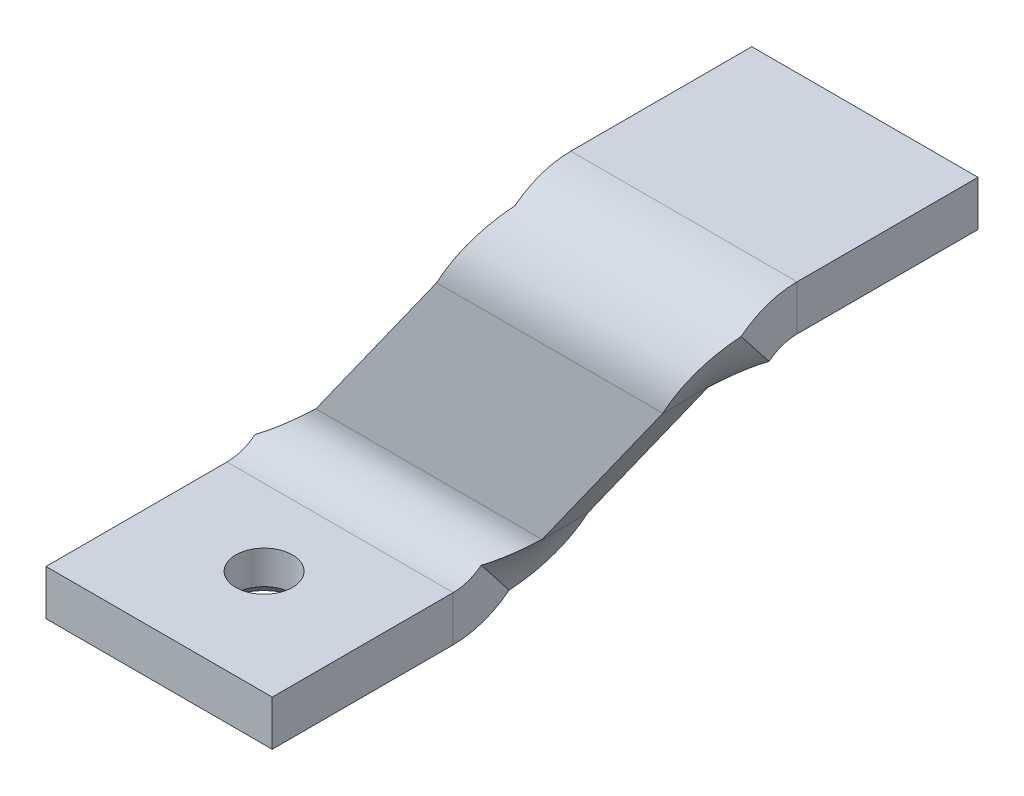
ISO-10303-21;
HEADER;
FILE_DESCRIPTION(('STEP AP214'),'2;1');
FILE_NAME('part.step','',(''),(''),'','','');
FILE_SCHEMA(('AUTOMOTIVE_DESIGN { 1 0 10303 214 1 1 1 1 }'));
ENDSEC;
DATA;
#1=APPLICATION_CONTEXT('core data for automotive mechanical design processes');
#2=APPLICATION_PROTOCOL_DEFINITION('international standard','automotive_design',2000,#1);
#3=PRODUCT_CONTEXT('',#1,'mechanical');
#4=PRODUCT('Part','Part','',(#3));
#5=PRODUCT_RELATED_PRODUCT_CATEGORY('part','',(#4));
#6=PRODUCT_DEFINITION_FORMATION('','',#4);
#7=PRODUCT_DEFINITION_CONTEXT('part definition',#1,'design');
#8=PRODUCT_DEFINITION('design','',#6,#7);
#9=PRODUCT_DEFINITION_SHAPE('','',#8);
#10=(LENGTH_UNIT() NAMED_UNIT(*) SI_UNIT(.MILLI.,.METRE.));
#11=(NAMED_UNIT(*) PLANE_ANGLE_UNIT() SI_UNIT($,.RADIAN.));
#12=(NAMED_UNIT(*) SI_UNIT($,.STERADIAN.) SOLID_ANGLE_UNIT());
#13=UNCERTAINTY_MEASURE_WITH_UNIT(LENGTH_MEASURE(1.E-05),#10,'distance_accuracy_value','');
#14=(GEOMETRIC_REPRESENTATION_CONTEXT(3) GLOBAL_UNCERTAINTY_ASSIGNED_CONTEXT((#13)) GLOBAL_UNIT_ASSIGNED_CONTEXT((#10,
#11,#12)) REPRESENTATION_CONTEXT('',''));
#15=CARTESIAN_POINT('',(0.,0.,0.));
#16=DIRECTION('',(0.,0.,1.));
#17=DIRECTION('',(1.,0.,0.));
#18=AXIS2_PLACEMENT_3D('',#15,#16,#17);
#19=CARTESIAN_POINT('',(0.,4.53818604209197,-12.2076110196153));
#20=DIRECTION('',(-0.814697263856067,0.579886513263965,0.));
#21=DIRECTION('',(0.579886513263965,0.814697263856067,0.));
#22=AXIS2_PLACEMENT_3D('',#19,#20,#21);
#23=PLANE('',#22);
#24=DIRECTION('',(0.579886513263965,0.814697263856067,0.));
#25=VECTOR('',#24,1.);
#26=CARTESIAN_POINT('',(0.,4.53818604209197,-12.2076110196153));
#27=LINE('',#26,#25);
#28=CARTESIAN_POINT('',(-7.26558959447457,-5.66942497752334,-12.2076110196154));
#29=VERTEX_POINT('',#28);
#30=CARTESIAN_POINT('',(-1.93062853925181,1.82579706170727,-12.2076110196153));
#31=VERTEX_POINT('',#30);
#32=EDGE_CURVE('E226',#29,#31,#27,.T.);
#33=ORIENTED_EDGE('',*,*,#32,.T.);
#34=CARTESIAN_POINT('',(-1.93062853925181,1.82579706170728,-14.2076110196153));
#35=CARTESIAN_POINT('',(-1.93062853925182,1.82579706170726,-12.2076110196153));
#36=B_SPLINE_CURVE_WITH_KNOTS('',1,(#34,#35),.UNSPECIFIED.,.F.,.F.,(2,2),(0.,1.),.UNSPECIFIED.);
#37=CARTESIAN_POINT('',(-1.93062853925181,1.82579706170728,-14.2076110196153));
#38=VERTEX_POINT('',#37);
#39=EDGE_CURVE('E12',#31,#38,#36,.F.);
#40=ORIENTED_EDGE('',*,*,#39,.T.);
#41=DIRECTION('',(0.579886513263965,0.814697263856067,0.));
#42=VECTOR('',#41,1.);
#43=CARTESIAN_POINT('',(0.,4.53818604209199,-14.2076110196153));
#44=LINE('',#43,#42);
#45=CARTESIAN_POINT('',(-7.26558959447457,-5.66942497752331,-14.2076110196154));
#46=VERTEX_POINT('',#45);
#47=EDGE_CURVE('E265',#46,#38,#44,.T.);
#48=ORIENTED_EDGE('',*,*,#47,.F.);
#49=CARTESIAN_POINT('',(-7.26558959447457,-5.66942497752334,-12.2076110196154));
#50=CARTESIAN_POINT('',(-7.26558959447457,-5.66942497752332,-14.2076110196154));
#51=B_SPLINE_CURVE_WITH_KNOTS('',1,(#49,#50),.UNSPECIFIED.,.F.,.F.,(2,2),(0.,1.),.UNSPECIFIED.);
#52=EDGE_CURVE('E262',#29,#46,#51,.T.);
#53=ORIENTED_EDGE('',*,*,#52,.F.);
#54=EDGE_LOOP('',(#33,#40,#48,#53));
#55=FACE_BOUND('',#54,.T.);
#56=ADVANCED_FACE('F74',(#55),#23,.T.);
#57=CARTESIAN_POINT('',(0.803781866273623,-8.38181395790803,-12.2076110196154));
#58=DIRECTION('',(0.814697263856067,-0.579886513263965,0.));
#59=DIRECTION('',(-0.579886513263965,-0.814697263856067,0.));
#60=AXIS2_PLACEMENT_3D('',#57,#58,#59);
#61=PLANE('',#60);
#62=DIRECTION('',(-0.579886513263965,-0.814697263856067,0.));
#63=VECTOR('',#62,1.);
#64=CARTESIAN_POINT('',(0.803781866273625,-8.38181395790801,-14.2076110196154));
#65=LINE('',#64,#63);
#66=CARTESIAN_POINT('',(8.06937146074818,1.82579706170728,-14.2076110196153));
#67=VERTEX_POINT('',#66);
#68=CARTESIAN_POINT('',(2.73441040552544,-5.66942497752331,-14.2076110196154));
#69=VERTEX_POINT('',#68);
#70=EDGE_CURVE('E99',#67,#69,#65,.T.);
#71=ORIENTED_EDGE('',*,*,#70,.F.);
#72=CARTESIAN_POINT('',(8.06937146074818,1.82579706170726,-12.2076110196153));
#73=CARTESIAN_POINT('',(8.06937146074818,1.82579706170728,-14.2076110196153));
#74=B_SPLINE_CURVE_WITH_KNOTS('',1,(#72,#73),.UNSPECIFIED.,.F.,.F.,(2,2),(0.,1.),.UNSPECIFIED.);
#75=CARTESIAN_POINT('',(8.06937146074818,1.82579706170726,-12.2076110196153));
#76=VERTEX_POINT('',#75);
#77=EDGE_CURVE('E202',#67,#76,#74,.F.);
#78=ORIENTED_EDGE('',*,*,#77,.T.);
#79=DIRECTION('',(-0.579886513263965,-0.814697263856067,0.));
#80=VECTOR('',#79,1.);
#81=CARTESIAN_POINT('',(0.803781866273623,-8.38181395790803,-12.2076110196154));
#82=LINE('',#81,#80);
#83=CARTESIAN_POINT('',(2.73441040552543,-5.66942497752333,-12.2076110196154));
#84=VERTEX_POINT('',#83);
#85=EDGE_CURVE('E220',#76,#84,#82,.T.);
#86=ORIENTED_EDGE('',*,*,#85,.T.);
#87=CARTESIAN_POINT('',(2.73441040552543,-5.66942497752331,-14.2076110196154));
#88=CARTESIAN_POINT('',(2.73441040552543,-5.66942497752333,-12.2076110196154));
#89=B_SPLINE_CURVE_WITH_KNOTS('',1,(#87,#88),.UNSPECIFIED.,.F.,.F.,(2,2),(0.,1.),.UNSPECIFIED.);
#90=EDGE_CURVE('E203',#69,#84,#89,.T.);
#91=ORIENTED_EDGE('',*,*,#90,.F.);
#92=EDGE_LOOP('',(#71,#78,#86,#91));
#93=FACE_BOUND('',#92,.T.);
#94=ADVANCED_FACE('F229',(#93),#61,.T.);
#95=CARTESIAN_POINT('',(0.,-2.55601689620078,-12.2076110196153));
#96=DIRECTION('',(0.,0.,1.));
#97=DIRECTION('',(-1.,0.,0.));
#98=AXIS2_PLACEMENT_3D('',#95,#96,#97);
#99=PLANE('',#98);
#100=ORIENTED_EDGE('',*,*,#85,.F.);
#101=DIRECTION('',(-1.,0.,0.));
#102=VECTOR('',#101,1.);
#103=CARTESIAN_POINT('',(0.,1.82579706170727,-12.2076110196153));
#104=LINE('',#103,#102);
#105=EDGE_CURVE('E191',#76,#31,#104,.T.);
#106=ORIENTED_EDGE('',*,*,#105,.T.);
#107=ORIENTED_EDGE('',*,*,#32,.F.);
#108=DIRECTION('',(-1.,0.,0.));
#109=VECTOR('',#108,1.);
#110=CARTESIAN_POINT('',(0.,-5.66942497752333,-12.2076110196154));
#111=LINE('',#110,#109);
#112=EDGE_CURVE('E223',#84,#29,#111,.T.);
#113=ORIENTED_EDGE('',*,*,#112,.F.);
#114=EDGE_LOOP('',(#100,#106,#107,#113));
#115=FACE_BOUND('',#114,.T.);
#116=ADVANCED_FACE('F221',(#115),#99,.T.);
#117=CARTESIAN_POINT('',(0.,-2.55601689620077,-14.2076110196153));
#118=DIRECTION('',(0.,0.,1.));
#119=DIRECTION('',(-1.,0.,0.));
#120=AXIS2_PLACEMENT_3D('',#117,#118,#119);
#121=PLANE('',#120);
#122=DIRECTION('',(-1.,0.,0.));
#123=VECTOR('',#122,1.);
#124=CARTESIAN_POINT('',(0.,1.82579706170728,-14.2076110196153));
#125=LINE('',#124,#123);
#126=EDGE_CURVE('E83',#67,#38,#125,.T.);
#127=ORIENTED_EDGE('',*,*,#126,.F.);
#128=ORIENTED_EDGE('',*,*,#70,.T.);
#129=DIRECTION('',(-1.,0.,0.));
#130=VECTOR('',#129,1.);
#131=CARTESIAN_POINT('',(0.,-5.6694249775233,-14.2076110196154));
#132=LINE('',#131,#130);
#133=EDGE_CURVE('E255',#69,#46,#132,.T.);
#134=ORIENTED_EDGE('',*,*,#133,.T.);
#135=ORIENTED_EDGE('',*,*,#47,.T.);
#136=EDGE_LOOP('',(#127,#128,#134,#135));
#137=FACE_BOUND('',#136,.T.);
#138=ADVANCED_FACE('F247',(#137),#121,.F.);
#139=CARTESIAN_POINT('',(-9.19621813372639,-7.66942497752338,-2.20761101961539));
#140=DIRECTION('',(0.,0.,1.));
#141=DIRECTION('',(0.,-1.,0.));
#142=AXIS2_PLACEMENT_3D('',#139,#140,#141);
#143=PLANE('',#142);
#144=DIRECTION('',(-1.,0.,0.));
#145=VECTOR('',#144,1.);
#146=CARTESIAN_POINT('',(-9.19621813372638,-9.66942497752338,-2.20761101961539));
#147=LINE('',#146,#145);
#148=CARTESIAN_POINT('',(0.803781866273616,-9.66942497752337,-2.20761101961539));
#149=VERTEX_POINT('',#148);
#150=CARTESIAN_POINT('',(-9.19621813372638,-9.66942497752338,-2.20761101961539));
#151=VERTEX_POINT('',#150);
#152=EDGE_CURVE('E440',#149,#151,#147,.T.);
#153=ORIENTED_EDGE('',*,*,#152,.F.);
#154=DIRECTION('',(0.,-1.,0.));
#155=VECTOR('',#154,1.);
#156=CARTESIAN_POINT('',(0.803781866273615,-7.66942497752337,-2.20761101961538));
#157=LINE('',#156,#155);
#158=CARTESIAN_POINT('',(0.803781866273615,-7.66942497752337,-2.20761101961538));
#159=VERTEX_POINT('',#158);
#160=EDGE_CURVE('E269',#159,#149,#157,.T.);
#161=ORIENTED_EDGE('',*,*,#160,.F.);
#162=DIRECTION('',(-1.,0.,0.));
#163=VECTOR('',#162,1.);
#164=CARTESIAN_POINT('',(-9.19621813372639,-7.66942497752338,-2.20761101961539));
#165=LINE('',#164,#163);
#166=CARTESIAN_POINT('',(-9.19621813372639,-7.66942497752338,-2.20761101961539));
#167=VERTEX_POINT('',#166);
#168=EDGE_CURVE('E455',#159,#167,#165,.T.);
#169=ORIENTED_EDGE('',*,*,#168,.T.);
#170=DIRECTION('',(0.,-1.,0.));
#171=VECTOR('',#170,1.);
#172=CARTESIAN_POINT('',(-9.19621813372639,-7.66942497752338,-2.20761101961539));
#173=LINE('',#172,#171);
#174=EDGE_CURVE('E454',#167,#151,#173,.T.);
#175=ORIENTED_EDGE('',*,*,#174,.T.);
#176=EDGE_LOOP('',(#153,#161,#169,#175));
#177=FACE_BOUND('',#176,.T.);
#178=ADVANCED_FACE('F513',(#177),#143,.T.);
#179=CARTESIAN_POINT('',(0.,-7.66942497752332,-18.0334080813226));
#180=DIRECTION('',(0.,1.,0.));
#181=DIRECTION('',(-1.,0.,0.));
#182=AXIS2_PLACEMENT_3D('',#179,#180,#181);
#183=PLANE('',#182);
#184=CARTESIAN_POINT('',(-4.19621813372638,-7.66942497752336,-6.84796832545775));
#185=DIRECTION('',(0.,1.,0.));
#186=DIRECTION('',(0.,0.,1.));
#187=AXIS2_PLACEMENT_3D('',#184,#185,#186);
#188=CIRCLE('',#187,1.24999999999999);
#189=CARTESIAN_POINT('',(-4.19621813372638,-7.66942497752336,-5.59796832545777));
#190=VERTEX_POINT('',#189);
#191=EDGE_CURVE('E78',#190,#190,#188,.T.);
#192=ORIENTED_EDGE('',*,*,#191,.F.);
#193=EDGE_LOOP('',(#192));
#194=FACE_BOUND('',#193,.T.);
#195=DIRECTION('',(0.,0.,1.));
#196=VECTOR('',#195,1.);
#197=CARTESIAN_POINT('',(0.803781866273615,-7.66942497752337,-2.20761101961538));
#198=LINE('',#197,#196);
#199=CARTESIAN_POINT('',(0.803781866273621,-7.66942497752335,-10.2076110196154));
#200=VERTEX_POINT('',#199);
#201=EDGE_CURVE('E432',#200,#159,#198,.T.);
#202=ORIENTED_EDGE('',*,*,#201,.F.);
#203=DIRECTION('',(-1.,0.,0.));
#204=VECTOR('',#203,1.);
#205=CARTESIAN_POINT('',(0.,-7.66942497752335,-10.2076110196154));
#206=LINE('',#205,#204);
#207=CARTESIAN_POINT('',(-9.19621813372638,-7.66942497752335,-10.2076110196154));
#208=VERTEX_POINT('',#207);
#209=EDGE_CURVE('E451',#200,#208,#206,.T.);
#210=ORIENTED_EDGE('',*,*,#209,.T.);
#211=DIRECTION('',(0.,0.,-1.));
#212=VECTOR('',#211,1.);
#213=CARTESIAN_POINT('',(-9.19621813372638,-7.66942497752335,-12.2076110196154));
#214=LINE('',#213,#212);
#215=EDGE_CURVE('E448',#167,#208,#214,.T.);
#216=ORIENTED_EDGE('',*,*,#215,.F.);
#217=ORIENTED_EDGE('',*,*,#168,.F.);
#218=EDGE_LOOP('',(#202,#210,#216,#217));
#219=FACE_BOUND('',#218,.T.);
#220=ADVANCED_FACE('F507',(#194,#219),#183,.T.);
#221=CARTESIAN_POINT('',(-9.19621813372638,-7.66942497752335,-12.2076110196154));
#222=DIRECTION('',(-1.,0.,0.));
#223=DIRECTION('',(0.,-1.,0.));
#224=AXIS2_PLACEMENT_3D('',#221,#222,#223);
#225=PLANE('',#224);
#226=ORIENTED_EDGE('',*,*,#215,.T.);
#227=DIRECTION('',(0.,-1.,0.));
#228=VECTOR('',#227,1.);
#229=CARTESIAN_POINT('',(-9.19621813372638,-7.66942497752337,-10.2076110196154));
#230=LINE('',#229,#228);
#231=CARTESIAN_POINT('',(-9.19621813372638,-9.66942497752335,-10.2076110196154));
#232=VERTEX_POINT('',#231);
#233=EDGE_CURVE('E445',#208,#232,#230,.T.);
#234=ORIENTED_EDGE('',*,*,#233,.T.);
#235=DIRECTION('',(0.,0.,-1.));
#236=VECTOR('',#235,1.);
#237=CARTESIAN_POINT('',(-9.19621813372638,-9.66942497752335,-12.2076110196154));
#238=LINE('',#237,#236);
#239=EDGE_CURVE('E437',#151,#232,#238,.T.);
#240=ORIENTED_EDGE('',*,*,#239,.F.);
#241=ORIENTED_EDGE('',*,*,#174,.F.);
#242=EDGE_LOOP('',(#226,#234,#240,#241));
#243=FACE_BOUND('',#242,.T.);
#244=ADVANCED_FACE('F503',(#243),#225,.T.);
#245=CARTESIAN_POINT('',(0.,-9.66942497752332,-18.0334080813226));
#246=DIRECTION('',(0.,1.,0.));
#247=DIRECTION('',(-1.,0.,0.));
#248=AXIS2_PLACEMENT_3D('',#245,#246,#247);
#249=PLANE('',#248);
#250=CARTESIAN_POINT('',(-4.19621813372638,-9.66942497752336,-6.84796832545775));
#251=DIRECTION('',(0.,-1.,0.));
#252=DIRECTION('',(0.,0.,-1.));
#253=AXIS2_PLACEMENT_3D('',#250,#251,#252);
#254=CIRCLE('',#253,1.775);
#255=CARTESIAN_POINT('',(-4.19621813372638,-9.66942497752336,-8.62296832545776));
#256=VERTEX_POINT('',#255);
#257=EDGE_CURVE('E905',#256,#256,#254,.T.);
#258=ORIENTED_EDGE('',*,*,#257,.F.);
#259=EDGE_LOOP('',(#258));
#260=FACE_BOUND('',#259,.T.);
#261=DIRECTION('',(-1.,0.,0.));
#262=VECTOR('',#261,1.);
#263=CARTESIAN_POINT('',(0.,-9.66942497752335,-10.2076110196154));
#264=LINE('',#263,#262);
#265=CARTESIAN_POINT('',(0.803781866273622,-9.66942497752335,-10.2076110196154));
#266=VERTEX_POINT('',#265);
#267=EDGE_CURVE('E290',#266,#232,#264,.T.);
#268=ORIENTED_EDGE('',*,*,#267,.F.);
#269=DIRECTION('',(0.,0.,1.));
#270=VECTOR('',#269,1.);
#271=CARTESIAN_POINT('',(0.803781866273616,-9.66942497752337,-2.20761101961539));
#272=LINE('',#271,#270);
#273=EDGE_CURVE('E443',#266,#149,#272,.T.);
#274=ORIENTED_EDGE('',*,*,#273,.T.);
#275=ORIENTED_EDGE('',*,*,#152,.T.);
#276=ORIENTED_EDGE('',*,*,#239,.T.);
#277=EDGE_LOOP('',(#268,#274,#275,#276));
#278=FACE_BOUND('',#277,.T.);
#279=ADVANCED_FACE('F512',(#260,#278),#249,.F.);
#280=CARTESIAN_POINT('',(0.803781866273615,-7.66942497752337,-2.20761101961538));
#281=DIRECTION('',(1.,0.,0.));
#282=DIRECTION('',(0.,0.,1.));
#283=AXIS2_PLACEMENT_3D('',#280,#281,#282);
#284=PLANE('',#283);
#285=ORIENTED_EDGE('',*,*,#273,.F.);
#286=DIRECTION('',(0.,1.,0.));
#287=VECTOR('',#286,1.);
#288=CARTESIAN_POINT('',(0.803781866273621,-7.66942497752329,-10.2076110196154));
#289=LINE('',#288,#287);
#290=EDGE_CURVE('E434',#266,#200,#289,.T.);
#291=ORIENTED_EDGE('',*,*,#290,.T.);
#292=ORIENTED_EDGE('',*,*,#201,.T.);
#293=ORIENTED_EDGE('',*,*,#160,.T.);
#294=EDGE_LOOP('',(#285,#291,#292,#293));
#295=FACE_BOUND('',#294,.T.);
#296=ADVANCED_FACE('F381',(#295),#284,.T.);
#297=CARTESIAN_POINT('',(0.803781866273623,-8.81297402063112,-12.6810902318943));
#298=CARTESIAN_POINT('',(1.12563234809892,-8.44015812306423,-13.1549026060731));
#299=CARTESIAN_POINT('',(1.44732471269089,-7.95892526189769,-13.5425022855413));
#300=CARTESIAN_POINT('',(2.09086755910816,-6.87451569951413,-14.06909618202));
#301=CARTESIAN_POINT('',(2.41255992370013,-6.27232617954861,-14.2076110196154));
#302=CARTESIAN_POINT('',(2.73441040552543,-5.66942497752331,-14.2076110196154));
#303=CARTESIAN_POINT('',(0.803781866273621,-7.24119949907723,-11.4443506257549));
#304=CARTESIAN_POINT('',(1.12560076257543,-7.05480984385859,-11.6812335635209));
#305=CARTESIAN_POINT('',(1.44732471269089,-6.81417511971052,-11.8750566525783));
#306=CARTESIAN_POINT('',(2.09086755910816,-6.27197033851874,-12.1383536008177));
#307=CARTESIAN_POINT('',(2.41259150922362,-5.97084599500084,-12.2076110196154));
#308=CARTESIAN_POINT('',(2.73441040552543,-5.66942497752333,-12.2076110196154));
#309=B_SPLINE_SURFACE_WITH_KNOTS('',1,3,((#297,#298,#299,#300,#301,#302),(#303,#304,#305,#306,
#307,#308)),.UNSPECIFIED.,.F.,.F.,.F.,(2,2),(4,2,4),(0.,1.),(0.,0.5,1.),.UNSPECIFIED.);
#310=CARTESIAN_POINT('',(0.803781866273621,-7.24119949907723,-11.4443506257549));
#311=CARTESIAN_POINT('',(0.803781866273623,-8.81297402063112,-12.6810902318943));
#312=B_SPLINE_CURVE_WITH_KNOTS('',1,(#310,#311),.UNSPECIFIED.,.F.,.F.,(2,2),(0.,1.),.UNSPECIFIED.);
#313=CARTESIAN_POINT('',(0.803781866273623,-8.81297402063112,-12.6810902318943));
#314=VERTEX_POINT('',#313);
#315=CARTESIAN_POINT('',(0.803781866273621,-7.24119949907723,-11.4443506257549));
#316=VERTEX_POINT('',#315);
#317=EDGE_CURVE('E413',#314,#316,#312,.F.);
#318=CARTESIAN_POINT('',(0.803781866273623,-8.81297402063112,-12.6810902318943));
#319=CARTESIAN_POINT('',(1.12563234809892,-8.44015812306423,-13.1549026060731));
#320=CARTESIAN_POINT('',(1.44732471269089,-7.95892526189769,-13.5425022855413));
#321=CARTESIAN_POINT('',(2.09086755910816,-6.87451569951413,-14.06909618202));
#322=CARTESIAN_POINT('',(2.41255992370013,-6.27232617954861,-14.2076110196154));
#323=CARTESIAN_POINT('',(2.73441040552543,-5.66942497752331,-14.2076110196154));
#324=B_SPLINE_CURVE_WITH_KNOTS('',3,(#318,#319,#320,#321,#322,#323),.UNSPECIFIED.,.F.,.F.,(4,2,
4),(0.,0.5,1.),.UNSPECIFIED.);
#325=EDGE_CURVE('E318',#314,#69,#324,.T.);
#326=CARTESIAN_POINT('',(2.73441040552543,-5.66942497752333,-12.2076110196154));
#327=CARTESIAN_POINT('',(2.41259150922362,-5.97084599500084,-12.2076110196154));
#328=CARTESIAN_POINT('',(2.09086755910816,-6.27197033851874,-12.1383536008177));
#329=CARTESIAN_POINT('',(1.44732471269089,-6.81417511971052,-11.8750566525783));
#330=CARTESIAN_POINT('',(1.12560076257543,-7.05480984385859,-11.6812335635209));
#331=CARTESIAN_POINT('',(0.803781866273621,-7.24119949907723,-11.4443506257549));
#332=B_SPLINE_CURVE_WITH_KNOTS('',3,(#326,#327,#328,#329,#330,#331),.UNSPECIFIED.,.F.,.F.,(4,2,
4),(0.,0.5,1.),.UNSPECIFIED.);
#333=EDGE_CURVE('E358',#316,#84,#332,.F.);
#334=ORIENTED_EDGE('',*,*,#317,.F.);
#335=ORIENTED_EDGE('',*,*,#325,.T.);
#336=ORIENTED_EDGE('',*,*,#90,.T.);
#337=ORIENTED_EDGE('',*,*,#333,.F.);
#338=EDGE_LOOP('',(#334,#335,#336,#337));
#339=FACE_BOUND('',#338,.T.);
#340=ADVANCED_FACE('F370',(#339),#309,.F.);
#341=CARTESIAN_POINT('',(-7.26558959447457,-5.66942497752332,-14.2076110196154));
#342=CARTESIAN_POINT('',(-7.58744007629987,-6.27232617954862,-14.2076110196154));
#343=CARTESIAN_POINT('',(-7.90913244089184,-6.87451569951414,-14.06909618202));
#344=CARTESIAN_POINT('',(-8.55267528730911,-7.95892526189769,-13.5425022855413));
#345=CARTESIAN_POINT('',(-8.87436765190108,-8.44015812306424,-13.1549026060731));
#346=CARTESIAN_POINT('',(-9.19621813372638,-8.81297402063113,-12.6810902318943));
#347=CARTESIAN_POINT('',(-7.26558959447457,-5.66942497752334,-12.2076110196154));
#348=CARTESIAN_POINT('',(-7.58740849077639,-5.97084599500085,-12.2076110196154));
#349=CARTESIAN_POINT('',(-7.90913244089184,-6.27197033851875,-12.1383536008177));
#350=CARTESIAN_POINT('',(-8.55267528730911,-6.81417511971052,-11.8750566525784));
#351=CARTESIAN_POINT('',(-8.87439923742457,-7.05480984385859,-11.6812335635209));
#352=CARTESIAN_POINT('',(-9.19621813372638,-7.24119949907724,-11.4443506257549));
#353=B_SPLINE_SURFACE_WITH_KNOTS('',1,3,((#341,#342,#343,#344,#345,#346),(#347,#348,#349,#350,
#351,#352)),.UNSPECIFIED.,.F.,.F.,.F.,(2,2),(4,2,4),(0.,1.),(0.,0.5,1.),.UNSPECIFIED.);
#354=CARTESIAN_POINT('',(-7.26558959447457,-5.66942497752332,-14.2076110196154));
#355=CARTESIAN_POINT('',(-7.58744007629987,-6.27232617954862,-14.2076110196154));
#356=CARTESIAN_POINT('',(-7.90913244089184,-6.87451569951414,-14.06909618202));
#357=CARTESIAN_POINT('',(-8.55267528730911,-7.95892526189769,-13.5425022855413));
#358=CARTESIAN_POINT('',(-8.87436765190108,-8.44015812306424,-13.1549026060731));
#359=CARTESIAN_POINT('',(-9.19621813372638,-8.81297402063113,-12.6810902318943));
#360=B_SPLINE_CURVE_WITH_KNOTS('',3,(#354,#355,#356,#357,#358,#359),.UNSPECIFIED.,.F.,.F.,(4,2,
4),(0.,0.5,1.),.UNSPECIFIED.);
#361=CARTESIAN_POINT('',(-9.19621813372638,-8.81297402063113,-12.6810902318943));
#362=VERTEX_POINT('',#361);
#363=EDGE_CURVE('E303',#46,#362,#360,.T.);
#364=CARTESIAN_POINT('',(-9.19621813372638,-8.81297402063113,-12.6810902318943));
#365=CARTESIAN_POINT('',(-9.19621813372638,-7.24119949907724,-11.4443506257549));
#366=B_SPLINE_CURVE_WITH_KNOTS('',1,(#364,#365),.UNSPECIFIED.,.F.,.F.,(2,2),(0.,1.),.UNSPECIFIED.);
#367=CARTESIAN_POINT('',(-9.19621813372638,-7.24119949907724,-11.4443506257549));
#368=VERTEX_POINT('',#367);
#369=EDGE_CURVE('E462',#362,#368,#366,.T.);
#370=CARTESIAN_POINT('',(-9.19621813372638,-7.24119949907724,-11.4443506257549));
#371=CARTESIAN_POINT('',(-8.87439923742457,-7.05480984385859,-11.6812335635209));
#372=CARTESIAN_POINT('',(-8.55267528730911,-6.81417511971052,-11.8750566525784));
#373=CARTESIAN_POINT('',(-7.90913244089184,-6.27197033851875,-12.1383536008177));
#374=CARTESIAN_POINT('',(-7.58740849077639,-5.97084599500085,-12.2076110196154));
#375=CARTESIAN_POINT('',(-7.26558959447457,-5.66942497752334,-12.2076110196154));
#376=B_SPLINE_CURVE_WITH_KNOTS('',3,(#370,#371,#372,#373,#374,#375),.UNSPECIFIED.,.F.,.F.,(4,2,
4),(0.,0.5,1.),.UNSPECIFIED.);
#377=EDGE_CURVE('E305',#29,#368,#376,.F.);
#378=ORIENTED_EDGE('',*,*,#52,.T.);
#379=ORIENTED_EDGE('',*,*,#363,.T.);
#380=ORIENTED_EDGE('',*,*,#369,.T.);
#381=ORIENTED_EDGE('',*,*,#377,.F.);
#382=EDGE_LOOP('',(#378,#379,#380,#381));
#383=FACE_BOUND('',#382,.T.);
#384=ADVANCED_FACE('F302',(#383),#353,.F.);
#385=CARTESIAN_POINT('',(-9.19621813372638,-5.66942497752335,-10.2076110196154));
#386=DIRECTION('',(1.,0.,0.));
#387=DIRECTION('',(0.,1.,0.));
#388=AXIS2_PLACEMENT_3D('',#385,#386,#387);
#389=PLANE('',#388);
#390=ORIENTED_EDGE('',*,*,#369,.F.);
#391=CARTESIAN_POINT('',(-9.19621813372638,-5.66942497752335,-10.2076110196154));
#392=DIRECTION('',(-1.,0.,0.));
#393=DIRECTION('',(0.,-1.,0.));
#394=AXIS2_PLACEMENT_3D('',#391,#392,#393);
#395=CIRCLE('',#394,4.);
#396=EDGE_CURVE('E317',#362,#232,#395,.T.);
#397=ORIENTED_EDGE('',*,*,#396,.T.);
#398=ORIENTED_EDGE('',*,*,#233,.F.);
#399=CARTESIAN_POINT('',(-9.19621813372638,-5.66942497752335,-10.2076110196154));
#400=DIRECTION('',(-1.,0.,0.));
#401=DIRECTION('',(0.,1.,0.));
#402=AXIS2_PLACEMENT_3D('',#399,#400,#401);
#403=CIRCLE('',#402,2.);
#404=EDGE_CURVE('E464',#368,#208,#403,.T.);
#405=ORIENTED_EDGE('',*,*,#404,.F.);
#406=EDGE_LOOP('',(#390,#397,#398,#405));
#407=FACE_BOUND('',#406,.T.);
#408=ADVANCED_FACE('F340',(#407),#389,.F.);
#409=CARTESIAN_POINT('',(0.803781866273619,-5.66942497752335,-10.2076110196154));
#410=DIRECTION('',(-1.,0.,0.));
#411=DIRECTION('',(0.,-1.,0.));
#412=AXIS2_PLACEMENT_3D('',#409,#410,#411);
#413=PLANE('',#412);
#414=CARTESIAN_POINT('',(0.803781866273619,-5.66942497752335,-10.2076110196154));
#415=DIRECTION('',(-1.,0.,0.));
#416=DIRECTION('',(0.,-1.,0.));
#417=AXIS2_PLACEMENT_3D('',#414,#415,#416);
#418=CIRCLE('',#417,4.);
#419=EDGE_CURVE('E350',#266,#314,#418,.F.);
#420=ORIENTED_EDGE('',*,*,#419,.T.);
#421=ORIENTED_EDGE('',*,*,#317,.T.);
#422=CARTESIAN_POINT('',(0.803781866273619,-5.66942497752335,-10.2076110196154));
#423=DIRECTION('',(1.,0.,0.));
#424=DIRECTION('',(0.,-1.,0.));
#425=AXIS2_PLACEMENT_3D('',#422,#423,#424);
#426=CIRCLE('',#425,2.);
#427=EDGE_CURVE('E463',#200,#316,#426,.T.);
#428=ORIENTED_EDGE('',*,*,#427,.F.);
#429=ORIENTED_EDGE('',*,*,#290,.F.);
#430=EDGE_LOOP('',(#420,#421,#428,#429));
#431=FACE_BOUND('',#430,.T.);
#432=ADVANCED_FACE('F385',(#431),#413,.F.);
#433=CARTESIAN_POINT('',(8.78632812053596,-5.66942497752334,-10.2076110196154));
#434=DIRECTION('',(-1.,0.,0.));
#435=DIRECTION('',(0.,-1.,0.));
#436=AXIS2_PLACEMENT_3D('',#433,#434,#435);
#437=CYLINDRICAL_SURFACE('',#436,2.);
#438=ORIENTED_EDGE('',*,*,#209,.F.);
#439=ORIENTED_EDGE('',*,*,#427,.T.);
#440=ORIENTED_EDGE('',*,*,#333,.T.);
#441=ORIENTED_EDGE('',*,*,#112,.T.);
#442=ORIENTED_EDGE('',*,*,#377,.T.);
#443=ORIENTED_EDGE('',*,*,#404,.T.);
#444=EDGE_LOOP('',(#438,#439,#440,#441,#442,#443));
#445=FACE_BOUND('',#444,.T.);
#446=ADVANCED_FACE('F337',(#445),#437,.F.);
#447=CARTESIAN_POINT('',(8.78632812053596,-5.66942497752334,-10.2076110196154));
#448=DIRECTION('',(-1.,0.,0.));
#449=DIRECTION('',(0.,-1.,0.));
#450=AXIS2_PLACEMENT_3D('',#447,#448,#449);
#451=CYLINDRICAL_SURFACE('',#450,4.);
#452=ORIENTED_EDGE('',*,*,#267,.T.);
#453=ORIENTED_EDGE('',*,*,#396,.F.);
#454=ORIENTED_EDGE('',*,*,#363,.F.);
#455=ORIENTED_EDGE('',*,*,#133,.F.);
#456=ORIENTED_EDGE('',*,*,#325,.F.);
#457=ORIENTED_EDGE('',*,*,#419,.F.);
#458=EDGE_LOOP('',(#452,#453,#454,#455,#456,#457));
#459=FACE_BOUND('',#458,.T.);
#460=ADVANCED_FACE('F314',(#459),#451,.T.);
#461=CARTESIAN_POINT('',(9.99999999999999,5.82579706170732,-24.2076110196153));
#462=DIRECTION('',(0.,0.,-1.));
#463=DIRECTION('',(1.,0.,0.));
#464=AXIS2_PLACEMENT_3D('',#461,#462,#463);
#465=PLANE('',#464);
#466=DIRECTION('',(1.,0.,0.));
#467=VECTOR('',#466,1.);
#468=CARTESIAN_POINT('',(9.99999999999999,3.82579706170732,-24.2076110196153));
#469=LINE('',#468,#467);
#470=CARTESIAN_POINT('',(0.,3.82579706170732,-24.2076110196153));
#471=VERTEX_POINT('',#470);
#472=CARTESIAN_POINT('',(9.99999999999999,3.82579706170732,-24.2076110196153));
#473=VERTEX_POINT('',#472);
#474=EDGE_CURVE('E916',#471,#473,#469,.T.);
#475=ORIENTED_EDGE('',*,*,#474,.F.);
#476=DIRECTION('',(0.,-1.,0.));
#477=VECTOR('',#476,1.);
#478=CARTESIAN_POINT('',(0.,5.82579706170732,-24.2076110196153));
#479=LINE('',#478,#477);
#480=CARTESIAN_POINT('',(0.,5.82579706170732,-24.2076110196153));
#481=VERTEX_POINT('',#480);
#482=EDGE_CURVE('E950',#481,#471,#479,.T.);
#483=ORIENTED_EDGE('',*,*,#482,.F.);
#484=DIRECTION('',(1.,0.,0.));
#485=VECTOR('',#484,1.);
#486=CARTESIAN_POINT('',(9.99999999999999,5.82579706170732,-24.2076110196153));
#487=LINE('',#486,#485);
#488=CARTESIAN_POINT('',(9.99999999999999,5.82579706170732,-24.2076110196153));
#489=VERTEX_POINT('',#488);
#490=EDGE_CURVE('E925',#481,#489,#487,.T.);
#491=ORIENTED_EDGE('',*,*,#490,.T.);
#492=DIRECTION('',(0.,-1.,0.));
#493=VECTOR('',#492,1.);
#494=CARTESIAN_POINT('',(9.99999999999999,5.82579706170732,-24.2076110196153));
#495=LINE('',#494,#493);
#496=EDGE_CURVE('E923',#489,#473,#495,.T.);
#497=ORIENTED_EDGE('',*,*,#496,.T.);
#498=EDGE_LOOP('',(#475,#483,#491,#497));
#499=FACE_BOUND('',#498,.T.);
#500=ADVANCED_FACE('F336',(#499),#465,.T.);
#501=CARTESIAN_POINT('',(0.,5.82579706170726,-7.11340808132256));
#502=DIRECTION('',(0.,1.,0.));
#503=DIRECTION('',(-1.,0.,0.));
#504=AXIS2_PLACEMENT_3D('',#501,#502,#503);
#505=PLANE('',#504);
#506=DIRECTION('',(-1.,0.,0.));
#507=VECTOR('',#506,1.);
#508=CARTESIAN_POINT('',(0.,5.82579706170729,-16.2076110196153));
#509=LINE('',#508,#507);
#510=CARTESIAN_POINT('',(10.,5.82579706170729,-16.2076110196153));
#511=VERTEX_POINT('',#510);
#512=CARTESIAN_POINT('',(0.,5.8257970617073,-16.2076110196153));
#513=VERTEX_POINT('',#512);
#514=EDGE_CURVE('E887',#511,#513,#509,.T.);
#515=ORIENTED_EDGE('',*,*,#514,.F.);
#516=DIRECTION('',(0.,0.,1.));
#517=VECTOR('',#516,1.);
#518=CARTESIAN_POINT('',(10.,5.82579706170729,-14.2076110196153));
#519=LINE('',#518,#517);
#520=EDGE_CURVE('E918',#489,#511,#519,.T.);
#521=ORIENTED_EDGE('',*,*,#520,.F.);
#522=ORIENTED_EDGE('',*,*,#490,.F.);
#523=DIRECTION('',(0.,0.,-1.));
#524=VECTOR('',#523,1.);
#525=CARTESIAN_POINT('',(0.,5.82579706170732,-24.2076110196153));
#526=LINE('',#525,#524);
#527=EDGE_CURVE('E948',#513,#481,#526,.T.);
#528=ORIENTED_EDGE('',*,*,#527,.F.);
#529=EDGE_LOOP('',(#515,#521,#522,#528));
#530=FACE_BOUND('',#529,.T.);
#531=ADVANCED_FACE('F619',(#530),#505,.T.);
#532=CARTESIAN_POINT('',(10.,5.82579706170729,-14.2076110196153));
#533=DIRECTION('',(1.,0.,0.));
#534=DIRECTION('',(0.,0.,1.));
#535=AXIS2_PLACEMENT_3D('',#532,#533,#534);
#536=PLANE('',#535);
#537=DIRECTION('',(0.,1.,0.));
#538=VECTOR('',#537,1.);
#539=CARTESIAN_POINT('',(10.,5.82579706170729,-16.2076110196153));
#540=LINE('',#539,#538);
#541=CARTESIAN_POINT('',(10.,3.8257970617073,-16.2076110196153));
#542=VERTEX_POINT('',#541);
#543=EDGE_CURVE('E928',#542,#511,#540,.T.);
#544=ORIENTED_EDGE('',*,*,#543,.F.);
#545=DIRECTION('',(0.,0.,1.));
#546=VECTOR('',#545,1.);
#547=CARTESIAN_POINT('',(10.,3.82579706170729,-14.2076110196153));
#548=LINE('',#547,#546);
#549=EDGE_CURVE('E914',#473,#542,#548,.T.);
#550=ORIENTED_EDGE('',*,*,#549,.F.);
#551=ORIENTED_EDGE('',*,*,#496,.F.);
#552=ORIENTED_EDGE('',*,*,#520,.T.);
#553=EDGE_LOOP('',(#544,#550,#551,#552));
#554=FACE_BOUND('',#553,.T.);
#555=ADVANCED_FACE('F631',(#554),#536,.T.);
#556=CARTESIAN_POINT('',(0.,3.82579706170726,-7.11340808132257));
#557=DIRECTION('',(0.,1.,0.));
#558=DIRECTION('',(-1.,0.,0.));
#559=AXIS2_PLACEMENT_3D('',#556,#557,#558);
#560=PLANE('',#559);
#561=ORIENTED_EDGE('',*,*,#549,.T.);
#562=DIRECTION('',(-1.,0.,0.));
#563=VECTOR('',#562,1.);
#564=CARTESIAN_POINT('',(0.,3.8257970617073,-16.2076110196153));
#565=LINE('',#564,#563);
#566=CARTESIAN_POINT('',(0.,3.8257970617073,-16.2076110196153));
#567=VERTEX_POINT('',#566);
#568=EDGE_CURVE('E892',#542,#567,#565,.T.);
#569=ORIENTED_EDGE('',*,*,#568,.T.);
#570=DIRECTION('',(0.,0.,-1.));
#571=VECTOR('',#570,1.);
#572=CARTESIAN_POINT('',(0.,3.82579706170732,-24.2076110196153));
#573=LINE('',#572,#571);
#574=EDGE_CURVE('E913',#567,#471,#573,.T.);
#575=ORIENTED_EDGE('',*,*,#574,.T.);
#576=ORIENTED_EDGE('',*,*,#474,.T.);
#577=EDGE_LOOP('',(#561,#569,#575,#576));
#578=FACE_BOUND('',#577,.T.);
#579=ADVANCED_FACE('F642',(#578),#560,.F.);
#580=CARTESIAN_POINT('',(0.,5.82579706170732,-24.2076110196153));
#581=DIRECTION('',(-1.,0.,0.));
#582=DIRECTION('',(0.,0.,-1.));
#583=AXIS2_PLACEMENT_3D('',#580,#581,#582);
#584=PLANE('',#583);
#585=DIRECTION('',(0.,-1.,0.));
#586=VECTOR('',#585,1.);
#587=CARTESIAN_POINT('',(0.,5.8257970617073,-16.2076110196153));
#588=LINE('',#587,#586);
#589=EDGE_CURVE('E930',#513,#567,#588,.T.);
#590=ORIENTED_EDGE('',*,*,#589,.F.);
#591=ORIENTED_EDGE('',*,*,#527,.T.);
#592=ORIENTED_EDGE('',*,*,#482,.T.);
#593=ORIENTED_EDGE('',*,*,#574,.F.);
#594=EDGE_LOOP('',(#590,#591,#592,#593));
#595=FACE_BOUND('',#594,.T.);
#596=ADVANCED_FACE('F654',(#595),#584,.T.);
#597=CARTESIAN_POINT('',(8.06937146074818,1.82579706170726,-12.2076110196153));
#598=CARTESIAN_POINT('',(8.39122194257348,2.42869826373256,-12.2076110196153));
#599=CARTESIAN_POINT('',(8.71291430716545,3.03088778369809,-12.3461258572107));
#600=CARTESIAN_POINT('',(9.35645715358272,4.11529734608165,-12.8727197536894));
#601=CARTESIAN_POINT('',(9.6781495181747,4.59653020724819,-13.2603194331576));
#602=CARTESIAN_POINT('',(9.99999999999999,4.96934610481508,-13.7341318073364));
#603=CARTESIAN_POINT('',(8.06937146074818,1.82579706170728,-14.2076110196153));
#604=CARTESIAN_POINT('',(8.39119035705,2.12721807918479,-14.2076110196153));
#605=CARTESIAN_POINT('',(8.71291430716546,2.42834242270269,-14.276868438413));
#606=CARTESIAN_POINT('',(9.35645715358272,2.97054720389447,-14.5401653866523));
#607=CARTESIAN_POINT('',(9.67818110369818,3.21118192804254,-14.7339884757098));
#608=CARTESIAN_POINT('',(9.99999999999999,3.39757158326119,-14.9708714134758));
#609=B_SPLINE_SURFACE_WITH_KNOTS('',1,3,((#597,#598,#599,#600,#601,#602),(#603,#604,#605,#606,
#607,#608)),.UNSPECIFIED.,.F.,.F.,.F.,(2,2),(4,2,4),(0.,1.),(0.,0.5,1.),.UNSPECIFIED.);
#610=CARTESIAN_POINT('',(8.06937146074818,1.82579706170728,-14.2076110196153));
#611=CARTESIAN_POINT('',(8.39119035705,2.12721807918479,-14.2076110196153));
#612=CARTESIAN_POINT('',(8.71291430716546,2.42834242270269,-14.276868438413));
#613=CARTESIAN_POINT('',(9.35645715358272,2.97054720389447,-14.5401653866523));
#614=CARTESIAN_POINT('',(9.67818110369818,3.21118192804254,-14.7339884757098));
#615=CARTESIAN_POINT('',(9.99999999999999,3.39757158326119,-14.9708714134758));
#616=B_SPLINE_CURVE_WITH_KNOTS('',3,(#610,#611,#612,#613,#614,#615),.UNSPECIFIED.,.F.,.F.,(4,2,
4),(0.,0.5,1.),.UNSPECIFIED.);
#617=CARTESIAN_POINT('',(9.99999999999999,3.39757158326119,-14.9708714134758));
#618=VERTEX_POINT('',#617);
#619=EDGE_CURVE('E889',#67,#618,#616,.T.);
#620=CARTESIAN_POINT('',(9.99999999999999,3.39757158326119,-14.9708714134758));
#621=CARTESIAN_POINT('',(9.99999999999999,4.96934610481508,-13.7341318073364));
#622=B_SPLINE_CURVE_WITH_KNOTS('',1,(#620,#621),.UNSPECIFIED.,.F.,.F.,(2,2),(0.,1.),.UNSPECIFIED.);
#623=CARTESIAN_POINT('',(9.99999999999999,4.96934610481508,-13.7341318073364));
#624=VERTEX_POINT('',#623);
#625=EDGE_CURVE('E212',#618,#624,#622,.T.);
#626=CARTESIAN_POINT('',(9.99999999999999,4.96934610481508,-13.7341318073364));
#627=CARTESIAN_POINT('',(9.6781495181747,4.59653020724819,-13.2603194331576));
#628=CARTESIAN_POINT('',(9.35645715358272,4.11529734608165,-12.8727197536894));
#629=CARTESIAN_POINT('',(8.71291430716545,3.03088778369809,-12.3461258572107));
#630=CARTESIAN_POINT('',(8.39122194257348,2.42869826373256,-12.2076110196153));
#631=CARTESIAN_POINT('',(8.06937146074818,1.82579706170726,-12.2076110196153));
#632=B_SPLINE_CURVE_WITH_KNOTS('',3,(#626,#627,#628,#629,#630,#631),.UNSPECIFIED.,.F.,.F.,(4,2,
4),(0.,0.5,1.),.UNSPECIFIED.);
#633=EDGE_CURVE('E195',#76,#624,#632,.F.);
#634=ORIENTED_EDGE('',*,*,#77,.F.);
#635=ORIENTED_EDGE('',*,*,#619,.T.);
#636=ORIENTED_EDGE('',*,*,#625,.T.);
#637=ORIENTED_EDGE('',*,*,#633,.F.);
#638=EDGE_LOOP('',(#634,#635,#636,#637));
#639=FACE_BOUND('',#638,.T.);
#640=ADVANCED_FACE('F207',(#639),#609,.T.);
#641=CARTESIAN_POINT('',(10.,1.8257970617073,-16.2076110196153));
#642=DIRECTION('',(1.,0.,0.));
#643=DIRECTION('',(0.,0.,-1.));
#644=AXIS2_PLACEMENT_3D('',#641,#642,#643);
#645=PLANE('',#644);
#646=ORIENTED_EDGE('',*,*,#625,.F.);
#647=CARTESIAN_POINT('',(9.99999999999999,1.8257970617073,-16.2076110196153));
#648=DIRECTION('',(1.,0.,0.));
#649=DIRECTION('',(0.,0.,-1.));
#650=AXIS2_PLACEMENT_3D('',#647,#648,#649);
#651=CIRCLE('',#650,2.);
#652=EDGE_CURVE('E806',#618,#542,#651,.F.);
#653=ORIENTED_EDGE('',*,*,#652,.T.);
#654=ORIENTED_EDGE('',*,*,#543,.T.);
#655=CARTESIAN_POINT('',(10.,1.8257970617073,-16.2076110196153));
#656=DIRECTION('',(-1.,0.,0.));
#657=DIRECTION('',(0.,0.,-1.));
#658=AXIS2_PLACEMENT_3D('',#655,#656,#657);
#659=CIRCLE('',#658,4.);
#660=EDGE_CURVE('E215',#624,#511,#659,.T.);
#661=ORIENTED_EDGE('',*,*,#660,.F.);
#662=EDGE_LOOP('',(#646,#653,#654,#661));
#663=FACE_BOUND('',#662,.T.);
#664=ADVANCED_FACE('F671',(#663),#645,.T.);
#665=CARTESIAN_POINT('',(0.,1.8257970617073,-16.2076110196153));
#666=DIRECTION('',(-1.,0.,0.));
#667=DIRECTION('',(0.,0.,1.));
#668=AXIS2_PLACEMENT_3D('',#665,#666,#667);
#669=PLANE('',#668);
#670=ORIENTED_EDGE('',*,*,#589,.T.);
#671=CARTESIAN_POINT('',(0.,1.8257970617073,-16.2076110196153));
#672=DIRECTION('',(1.,0.,0.));
#673=DIRECTION('',(0.,0.,-1.));
#674=AXIS2_PLACEMENT_3D('',#671,#672,#673);
#675=CIRCLE('',#674,2.);
#676=CARTESIAN_POINT('',(0.,3.39757158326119,-14.9708714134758));
#677=VERTEX_POINT('',#676);
#678=EDGE_CURVE('E798',#567,#677,#675,.T.);
#679=ORIENTED_EDGE('',*,*,#678,.T.);
#680=CARTESIAN_POINT('',(0.,4.96934610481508,-13.7341318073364));
#681=CARTESIAN_POINT('',(0.,3.39757158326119,-14.9708714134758));
#682=B_SPLINE_CURVE_WITH_KNOTS('',1,(#680,#681),.UNSPECIFIED.,.F.,.F.,(2,2),(0.,1.),.UNSPECIFIED.);
#683=CARTESIAN_POINT('',(0.,4.96934610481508,-13.7341318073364));
#684=VERTEX_POINT('',#683);
#685=EDGE_CURVE('E849',#677,#684,#682,.F.);
#686=ORIENTED_EDGE('',*,*,#685,.T.);
#687=CARTESIAN_POINT('',(0.,1.8257970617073,-16.2076110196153));
#688=DIRECTION('',(1.,0.,0.));
#689=DIRECTION('',(0.,0.,1.));
#690=AXIS2_PLACEMENT_3D('',#687,#688,#689);
#691=CIRCLE('',#690,4.);
#692=EDGE_CURVE('E787',#513,#684,#691,.T.);
#693=ORIENTED_EDGE('',*,*,#692,.F.);
#694=EDGE_LOOP('',(#670,#679,#686,#693));
#695=FACE_BOUND('',#694,.T.);
#696=ADVANCED_FACE('F681',(#695),#669,.T.);
#697=CARTESIAN_POINT('',(0.,4.96934610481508,-13.7341318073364));
#698=CARTESIAN_POINT('',(-0.3218504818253,4.59653020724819,-13.2603194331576));
#699=CARTESIAN_POINT('',(-0.643542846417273,4.11529734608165,-12.8727197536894));
#700=CARTESIAN_POINT('',(-1.28708569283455,3.03088778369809,-12.3461258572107));
#701=CARTESIAN_POINT('',(-1.60877805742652,2.42869826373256,-12.2076110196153));
#702=CARTESIAN_POINT('',(-1.93062853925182,1.82579706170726,-12.2076110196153));
#703=CARTESIAN_POINT('',(0.,3.39757158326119,-14.9708714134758));
#704=CARTESIAN_POINT('',(-0.321818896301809,3.21118192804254,-14.7339884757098));
#705=CARTESIAN_POINT('',(-0.643542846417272,2.97054720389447,-14.5401653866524));
#706=CARTESIAN_POINT('',(-1.28708569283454,2.42834242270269,-14.276868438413));
#707=CARTESIAN_POINT('',(-1.60880964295,2.12721807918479,-14.2076110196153));
#708=CARTESIAN_POINT('',(-1.93062853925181,1.82579706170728,-14.2076110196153));
#709=B_SPLINE_SURFACE_WITH_KNOTS('',1,3,((#697,#698,#699,#700,#701,#702),(#703,#704,#705,#706,
#707,#708)),.UNSPECIFIED.,.F.,.F.,.F.,(2,2),(4,2,4),(0.,1.),(0.,0.5,1.),.UNSPECIFIED.);
#710=CARTESIAN_POINT('',(0.,3.39757158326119,-14.9708714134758));
#711=CARTESIAN_POINT('',(-0.321818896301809,3.21118192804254,-14.7339884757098));
#712=CARTESIAN_POINT('',(-0.643542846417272,2.97054720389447,-14.5401653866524));
#713=CARTESIAN_POINT('',(-1.28708569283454,2.42834242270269,-14.276868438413));
#714=CARTESIAN_POINT('',(-1.60880964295,2.12721807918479,-14.2076110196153));
#715=CARTESIAN_POINT('',(-1.93062853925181,1.82579706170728,-14.2076110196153));
#716=B_SPLINE_CURVE_WITH_KNOTS('',3,(#710,#711,#712,#713,#714,#715),.UNSPECIFIED.,.F.,.F.,(4,2,
4),(0.,0.5,1.),.UNSPECIFIED.);
#717=EDGE_CURVE('E216',#677,#38,#716,.T.);
#718=CARTESIAN_POINT('',(-1.93062853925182,1.82579706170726,-12.2076110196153));
#719=CARTESIAN_POINT('',(-1.60877805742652,2.42869826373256,-12.2076110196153));
#720=CARTESIAN_POINT('',(-1.28708569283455,3.03088778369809,-12.3461258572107));
#721=CARTESIAN_POINT('',(-0.643542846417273,4.11529734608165,-12.8727197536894));
#722=CARTESIAN_POINT('',(-0.3218504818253,4.59653020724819,-13.2603194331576));
#723=CARTESIAN_POINT('',(0.,4.96934610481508,-13.7341318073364));
#724=B_SPLINE_CURVE_WITH_KNOTS('',3,(#718,#719,#720,#721,#722,#723),.UNSPECIFIED.,.F.,.F.,(4,2,
4),(0.,0.5,1.),.UNSPECIFIED.);
#725=EDGE_CURVE('E90',#684,#31,#724,.F.);
#726=ORIENTED_EDGE('',*,*,#717,.T.);
#727=ORIENTED_EDGE('',*,*,#39,.F.);
#728=ORIENTED_EDGE('',*,*,#725,.F.);
#729=ORIENTED_EDGE('',*,*,#685,.F.);
#730=EDGE_LOOP('',(#726,#727,#728,#729));
#731=FACE_BOUND('',#730,.T.);
#732=ADVANCED_FACE('F692',(#731),#709,.T.);
#733=CARTESIAN_POINT('',(-7.98254625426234,1.8257970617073,-16.2076110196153));
#734=DIRECTION('',(1.,0.,0.));
#735=DIRECTION('',(0.,0.,-1.));
#736=AXIS2_PLACEMENT_3D('',#733,#734,#735);
#737=CYLINDRICAL_SURFACE('',#736,4.);
#738=ORIENTED_EDGE('',*,*,#692,.T.);
#739=ORIENTED_EDGE('',*,*,#725,.T.);
#740=ORIENTED_EDGE('',*,*,#105,.F.);
#741=ORIENTED_EDGE('',*,*,#633,.T.);
#742=ORIENTED_EDGE('',*,*,#660,.T.);
#743=ORIENTED_EDGE('',*,*,#514,.T.);
#744=EDGE_LOOP('',(#738,#739,#740,#741,#742,#743));
#745=FACE_BOUND('',#744,.T.);
#746=ADVANCED_FACE('F193',(#745),#737,.T.);
#747=CARTESIAN_POINT('',(-7.98254625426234,1.8257970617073,-16.2076110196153));
#748=DIRECTION('',(1.,0.,0.));
#749=DIRECTION('',(0.,0.,-1.));
#750=AXIS2_PLACEMENT_3D('',#747,#748,#749);
#751=CYLINDRICAL_SURFACE('',#750,2.);
#752=ORIENTED_EDGE('',*,*,#678,.F.);
#753=ORIENTED_EDGE('',*,*,#568,.F.);
#754=ORIENTED_EDGE('',*,*,#652,.F.);
#755=ORIENTED_EDGE('',*,*,#619,.F.);
#756=ORIENTED_EDGE('',*,*,#126,.T.);
#757=ORIENTED_EDGE('',*,*,#717,.F.);
#758=EDGE_LOOP('',(#752,#753,#754,#755,#756,#757));
#759=FACE_BOUND('',#758,.T.);
#760=ADVANCED_FACE('F713',(#759),#751,.F.);
#761=CARTESIAN_POINT('',(-4.19621813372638,-9.66942497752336,-6.84796832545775));
#762=DIRECTION('',(0.,-1.,0.));
#763=DIRECTION('',(0.,0.,-1.));
#764=AXIS2_PLACEMENT_3D('',#761,#762,#763);
#765=CYLINDRICAL_SURFACE('',#764,1.24999999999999);
#766=ORIENTED_EDGE('',*,*,#191,.T.);
#767=EDGE_LOOP('',(#766));
#768=FACE_BOUND('',#767,.T.);
#769=CARTESIAN_POINT('',(-4.19621813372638,-9.14442497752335,-6.84796832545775));
#770=DIRECTION('',(0.,-1.,0.));
#771=DIRECTION('',(0.,0.,-1.));
#772=AXIS2_PLACEMENT_3D('',#769,#770,#771);
#773=CIRCLE('',#772,1.24999999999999);
#774=CARTESIAN_POINT('',(-4.19621813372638,-9.14442497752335,-8.09796832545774));
#775=VERTEX_POINT('',#774);
#776=EDGE_CURVE('E902',#775,#775,#773,.T.);
#777=ORIENTED_EDGE('',*,*,#776,.T.);
#778=EDGE_LOOP('',(#777));
#779=FACE_BOUND('',#778,.T.);
#780=ADVANCED_FACE('F723',(#768,#779),#765,.F.);
#781=CARTESIAN_POINT('',(-4.19621813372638,-9.66942497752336,-6.84796832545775));
#782=DIRECTION('',(0.,-1.,0.));
#783=DIRECTION('',(0.,0.,-1.));
#784=AXIS2_PLACEMENT_3D('',#781,#782,#783);
#785=CONICAL_SURFACE('',#784,1.775,0.785398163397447);
#786=ORIENTED_EDGE('',*,*,#776,.F.);
#787=EDGE_LOOP('',(#786));
#788=FACE_BOUND('',#787,.T.);
#789=ORIENTED_EDGE('',*,*,#257,.T.);
#790=EDGE_LOOP('',(#789));
#791=FACE_BOUND('',#790,.T.);
#792=ADVANCED_FACE('F748',(#788,#791),#785,.F.);
#793=CLOSED_SHELL('',(#56,#94,#116,#138,#178,#220,#244,#279,#296,#340,#384,#408,#432,#446,#460,
#500,#531,#555,#579,#596,#640,#664,#696,#732,#746,#760,#780,#792));
#794=MANIFOLD_SOLID_BREP('B2',#793);
#795=ADVANCED_BREP_SHAPE_REPRESENTATION('',(#18,#794),#14);
#796=SHAPE_DEFINITION_REPRESENTATION(#9,#795);
ENDSEC;
END-ISO-10303-21;
